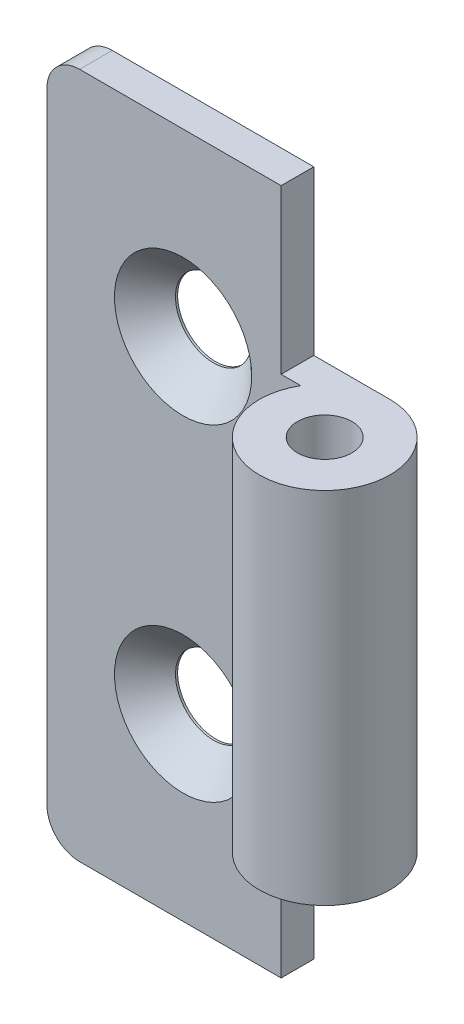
ISO-10303-21;
HEADER;
FILE_DESCRIPTION(('STEP AP214'),'2;1');
FILE_NAME('part.step','',(''),(''),'','','');
FILE_SCHEMA(('AUTOMOTIVE_DESIGN { 1 0 10303 214 1 1 1 1 }'));
ENDSEC;
DATA;
#1=APPLICATION_CONTEXT('core data for automotive mechanical design processes');
#2=APPLICATION_PROTOCOL_DEFINITION('international standard','automotive_design',2000,#1);
#3=PRODUCT_CONTEXT('',#1,'mechanical');
#4=PRODUCT('Part','Part','',(#3));
#5=PRODUCT_RELATED_PRODUCT_CATEGORY('part','',(#4));
#6=PRODUCT_DEFINITION_FORMATION('','',#4);
#7=PRODUCT_DEFINITION_CONTEXT('part definition',#1,'design');
#8=PRODUCT_DEFINITION('design','',#6,#7);
#9=PRODUCT_DEFINITION_SHAPE('','',#8);
#10=(LENGTH_UNIT() NAMED_UNIT(*) SI_UNIT(.MILLI.,.METRE.));
#11=(NAMED_UNIT(*) PLANE_ANGLE_UNIT() SI_UNIT($,.RADIAN.));
#12=(NAMED_UNIT(*) SI_UNIT($,.STERADIAN.) SOLID_ANGLE_UNIT());
#13=UNCERTAINTY_MEASURE_WITH_UNIT(LENGTH_MEASURE(1.E-05),#10,'distance_accuracy_value','');
#14=(GEOMETRIC_REPRESENTATION_CONTEXT(3) GLOBAL_UNCERTAINTY_ASSIGNED_CONTEXT((#13)) GLOBAL_UNIT_ASSIGNED_CONTEXT((#10,
#11,#12)) REPRESENTATION_CONTEXT('',''));
#15=CARTESIAN_POINT('',(0.,0.,0.));
#16=DIRECTION('',(0.,0.,1.));
#17=DIRECTION('',(1.,0.,0.));
#18=AXIS2_PLACEMENT_3D('',#15,#16,#17);
#19=CARTESIAN_POINT('',(0.,63.,0.));
#20=DIRECTION('',(0.,-1.,0.));
#21=DIRECTION('',(0.,0.,-1.));
#22=AXIS2_PLACEMENT_3D('',#19,#20,#21);
#23=CYLINDRICAL_SURFACE('',#22,6.);
#24=CARTESIAN_POINT('',(0.,15.,0.));
#25=DIRECTION('',(0.,1.,0.));
#26=DIRECTION('',(0.,0.,1.));
#27=AXIS2_PLACEMENT_3D('',#24,#25,#26);
#28=CIRCLE('',#27,6.);
#29=CARTESIAN_POINT('',(-5.19615242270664,15.,-3.));
#30=VERTEX_POINT('',#29);
#31=CARTESIAN_POINT('',(0.,15.,-6.));
#32=VERTEX_POINT('',#31);
#33=EDGE_CURVE('E145',#30,#32,#28,.T.);
#34=ORIENTED_EDGE('',*,*,#33,.T.);
#35=DIRECTION('',(0.,-1.,0.));
#36=VECTOR('',#35,1.);
#37=CARTESIAN_POINT('',(0.,63.,-6.));
#38=LINE('',#37,#36);
#39=CARTESIAN_POINT('',(0.,48.,-6.));
#40=VERTEX_POINT('',#39);
#41=EDGE_CURVE('E140',#40,#32,#38,.T.);
#42=ORIENTED_EDGE('',*,*,#41,.F.);
#43=CARTESIAN_POINT('',(0.,48.,0.));
#44=DIRECTION('',(0.,-1.,0.));
#45=DIRECTION('',(0.,0.,-1.));
#46=AXIS2_PLACEMENT_3D('',#43,#44,#45);
#47=CIRCLE('',#46,6.);
#48=CARTESIAN_POINT('',(-5.19615242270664,48.,-3.));
#49=VERTEX_POINT('',#48);
#50=EDGE_CURVE('E157',#40,#49,#47,.T.);
#51=ORIENTED_EDGE('',*,*,#50,.T.);
#52=DIRECTION('',(0.,-1.,0.));
#53=VECTOR('',#52,1.);
#54=CARTESIAN_POINT('',(-5.19615242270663,63.,-3.));
#55=LINE('',#54,#53);
#56=EDGE_CURVE('E165',#49,#30,#55,.T.);
#57=ORIENTED_EDGE('',*,*,#56,.T.);
#58=EDGE_LOOP('',(#34,#42,#51,#57));
#59=FACE_BOUND('',#58,.T.);
#60=ADVANCED_FACE('F35',(#59),#23,.T.);
#61=CARTESIAN_POINT('',(0.,63.,-6.));
#62=DIRECTION('',(0.,0.,1.));
#63=DIRECTION('',(1.,0.,0.));
#64=AXIS2_PLACEMENT_3D('',#61,#62,#63);
#65=PLANE('',#64);
#66=CARTESIAN_POINT('',(-16.,46.5,-6.));
#67=DIRECTION('',(0.,0.,1.));
#68=DIRECTION('',(1.,0.,0.));
#69=AXIS2_PLACEMENT_3D('',#66,#67,#68);
#70=CIRCLE('',#69,3.5);
#71=CARTESIAN_POINT('',(-12.5,46.5,-6.));
#72=VERTEX_POINT('',#71);
#73=EDGE_CURVE('E368',#72,#72,#70,.T.);
#74=ORIENTED_EDGE('',*,*,#73,.T.);
#75=EDGE_LOOP('',(#74));
#76=FACE_BOUND('',#75,.T.);
#77=CARTESIAN_POINT('',(-16.,16.5,-6.));
#78=DIRECTION('',(0.,0.,1.));
#79=DIRECTION('',(1.,0.,0.));
#80=AXIS2_PLACEMENT_3D('',#77,#78,#79);
#81=CIRCLE('',#80,3.5);
#82=CARTESIAN_POINT('',(-12.5,16.5,-6.));
#83=VERTEX_POINT('',#82);
#84=EDGE_CURVE('E135',#83,#83,#81,.T.);
#85=ORIENTED_EDGE('',*,*,#84,.T.);
#86=EDGE_LOOP('',(#85));
#87=FACE_BOUND('',#86,.T.);
#88=DIRECTION('',(-1.,0.,0.));
#89=VECTOR('',#88,1.);
#90=CARTESIAN_POINT('',(0.,0.,-6.));
#91=LINE('',#90,#89);
#92=CARTESIAN_POINT('',(-7.00000000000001,0.,-6.));
#93=VERTEX_POINT('',#92);
#94=CARTESIAN_POINT('',(-25.5,0.,-6.));
#95=VERTEX_POINT('',#94);
#96=EDGE_CURVE('E159',#93,#95,#91,.T.);
#97=ORIENTED_EDGE('',*,*,#96,.T.);
#98=CARTESIAN_POINT('',(-25.5,3.,-6.));
#99=DIRECTION('',(0.,0.,1.));
#100=DIRECTION('',(1.,0.,0.));
#101=AXIS2_PLACEMENT_3D('',#98,#99,#100);
#102=CIRCLE('',#101,3.);
#103=CARTESIAN_POINT('',(-28.5,3.,-6.));
#104=VERTEX_POINT('',#103);
#105=EDGE_CURVE('E44',#95,#104,#102,.F.);
#106=ORIENTED_EDGE('',*,*,#105,.T.);
#107=DIRECTION('',(0.,-1.,0.));
#108=VECTOR('',#107,1.);
#109=CARTESIAN_POINT('',(-28.5,63.,-6.));
#110=LINE('',#109,#108);
#111=CARTESIAN_POINT('',(-28.5,60.,-6.));
#112=VERTEX_POINT('',#111);
#113=EDGE_CURVE('E173',#112,#104,#110,.T.);
#114=ORIENTED_EDGE('',*,*,#113,.F.);
#115=CARTESIAN_POINT('',(-25.5,60.,-6.));
#116=DIRECTION('',(0.,0.,1.));
#117=DIRECTION('',(1.,0.,0.));
#118=AXIS2_PLACEMENT_3D('',#115,#116,#117);
#119=CIRCLE('',#118,3.);
#120=CARTESIAN_POINT('',(-25.5,63.,-6.));
#121=VERTEX_POINT('',#120);
#122=EDGE_CURVE('E51',#112,#121,#119,.F.);
#123=ORIENTED_EDGE('',*,*,#122,.T.);
#124=DIRECTION('',(-1.,0.,0.));
#125=VECTOR('',#124,1.);
#126=CARTESIAN_POINT('',(0.,63.,-6.));
#127=LINE('',#126,#125);
#128=CARTESIAN_POINT('',(-7.,63.,-6.));
#129=VERTEX_POINT('',#128);
#130=EDGE_CURVE('E160',#129,#121,#127,.T.);
#131=ORIENTED_EDGE('',*,*,#130,.F.);
#132=DIRECTION('',(0.,1.,0.));
#133=VECTOR('',#132,1.);
#134=CARTESIAN_POINT('',(-7.,48.,-6.));
#135=LINE('',#134,#133);
#136=CARTESIAN_POINT('',(-7.,48.,-6.));
#137=VERTEX_POINT('',#136);
#138=EDGE_CURVE('E150',#137,#129,#135,.T.);
#139=ORIENTED_EDGE('',*,*,#138,.F.);
#140=DIRECTION('',(-1.,0.,0.));
#141=VECTOR('',#140,1.);
#142=CARTESIAN_POINT('',(13.5139084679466,48.,-6.));
#143=LINE('',#142,#141);
#144=EDGE_CURVE('E147',#40,#137,#143,.T.);
#145=ORIENTED_EDGE('',*,*,#144,.F.);
#146=ORIENTED_EDGE('',*,*,#41,.T.);
#147=DIRECTION('',(1.,0.,0.));
#148=VECTOR('',#147,1.);
#149=CARTESIAN_POINT('',(13.5139084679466,15.,-6.));
#150=LINE('',#149,#148);
#151=CARTESIAN_POINT('',(-7.,15.,-6.));
#152=VERTEX_POINT('',#151);
#153=EDGE_CURVE('E121',#152,#32,#150,.T.);
#154=ORIENTED_EDGE('',*,*,#153,.F.);
#155=DIRECTION('',(0.,1.,0.));
#156=VECTOR('',#155,1.);
#157=CARTESIAN_POINT('',(-7.,15.,-6.));
#158=LINE('',#157,#156);
#159=EDGE_CURVE('E131',#93,#152,#158,.T.);
#160=ORIENTED_EDGE('',*,*,#159,.F.);
#161=EDGE_LOOP('',(#97,#106,#114,#123,#131,#139,#145,#146,#154,#160));
#162=FACE_BOUND('',#161,.T.);
#163=ADVANCED_FACE('F137',(#76,#87,#162),#65,.F.);
#164=CARTESIAN_POINT('',(-28.5,63.,-6.));
#165=DIRECTION('',(1.,0.,0.));
#166=DIRECTION('',(0.,0.,-1.));
#167=AXIS2_PLACEMENT_3D('',#164,#165,#166);
#168=PLANE('',#167);
#169=ORIENTED_EDGE('',*,*,#113,.T.);
#170=DIRECTION('',(0.,0.,1.));
#171=VECTOR('',#170,1.);
#172=CARTESIAN_POINT('',(-28.5,3.,-6.));
#173=LINE('',#172,#171);
#174=CARTESIAN_POINT('',(-28.5,3.,-3.));
#175=VERTEX_POINT('',#174);
#176=EDGE_CURVE('E187',#104,#175,#173,.T.);
#177=ORIENTED_EDGE('',*,*,#176,.T.);
#178=DIRECTION('',(0.,-1.,0.));
#179=VECTOR('',#178,1.);
#180=CARTESIAN_POINT('',(-28.5,63.,-3.));
#181=LINE('',#180,#179);
#182=CARTESIAN_POINT('',(-28.5,60.,-3.));
#183=VERTEX_POINT('',#182);
#184=EDGE_CURVE('E170',#183,#175,#181,.T.);
#185=ORIENTED_EDGE('',*,*,#184,.F.);
#186=DIRECTION('',(0.,0.,1.));
#187=VECTOR('',#186,1.);
#188=CARTESIAN_POINT('',(-28.5,60.,-6.));
#189=LINE('',#188,#187);
#190=EDGE_CURVE('E185',#183,#112,#189,.F.);
#191=ORIENTED_EDGE('',*,*,#190,.T.);
#192=EDGE_LOOP('',(#169,#177,#185,#191));
#193=FACE_BOUND('',#192,.T.);
#194=ADVANCED_FACE('F200',(#193),#168,.F.);
#195=CARTESIAN_POINT('',(-28.5,63.,-3.));
#196=DIRECTION('',(0.,0.,-1.));
#197=DIRECTION('',(-1.,0.,0.));
#198=AXIS2_PLACEMENT_3D('',#195,#196,#197);
#199=PLANE('',#198);
#200=CARTESIAN_POINT('',(-16.,46.5,-3.));
#201=DIRECTION('',(0.,0.,1.));
#202=DIRECTION('',(1.,0.,0.));
#203=AXIS2_PLACEMENT_3D('',#200,#201,#202);
#204=CIRCLE('',#203,6.3);
#205=CARTESIAN_POINT('',(-9.7,46.5,-3.));
#206=VERTEX_POINT('',#205);
#207=EDGE_CURVE('E362',#206,#206,#204,.T.);
#208=ORIENTED_EDGE('',*,*,#207,.F.);
#209=EDGE_LOOP('',(#208));
#210=FACE_BOUND('',#209,.T.);
#211=CARTESIAN_POINT('',(-16.,16.5,-3.));
#212=DIRECTION('',(0.,0.,1.));
#213=DIRECTION('',(1.,0.,0.));
#214=AXIS2_PLACEMENT_3D('',#211,#212,#213);
#215=CIRCLE('',#214,6.3);
#216=CARTESIAN_POINT('',(-9.7,16.5,-3.));
#217=VERTEX_POINT('',#216);
#218=EDGE_CURVE('E365',#217,#217,#215,.T.);
#219=ORIENTED_EDGE('',*,*,#218,.F.);
#220=EDGE_LOOP('',(#219));
#221=FACE_BOUND('',#220,.T.);
#222=ORIENTED_EDGE('',*,*,#184,.T.);
#223=CARTESIAN_POINT('',(-25.5,3.,-3.));
#224=DIRECTION('',(0.,0.,-1.));
#225=DIRECTION('',(-1.,0.,0.));
#226=AXIS2_PLACEMENT_3D('',#223,#224,#225);
#227=CIRCLE('',#226,3.);
#228=CARTESIAN_POINT('',(-25.5,0.,-3.));
#229=VERTEX_POINT('',#228);
#230=EDGE_CURVE('E192',#175,#229,#227,.F.);
#231=ORIENTED_EDGE('',*,*,#230,.T.);
#232=DIRECTION('',(1.,0.,0.));
#233=VECTOR('',#232,1.);
#234=CARTESIAN_POINT('',(-28.5,0.,-3.));
#235=LINE('',#234,#233);
#236=CARTESIAN_POINT('',(-7.00000000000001,0.,-3.));
#237=VERTEX_POINT('',#236);
#238=EDGE_CURVE('E163',#229,#237,#235,.T.);
#239=ORIENTED_EDGE('',*,*,#238,.T.);
#240=DIRECTION('',(0.,1.,0.));
#241=VECTOR('',#240,1.);
#242=CARTESIAN_POINT('',(-6.99999999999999,63.,-3.));
#243=LINE('',#242,#241);
#244=CARTESIAN_POINT('',(-7.,15.,-2.99999999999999));
#245=VERTEX_POINT('',#244);
#246=EDGE_CURVE('E128',#237,#245,#243,.T.);
#247=ORIENTED_EDGE('',*,*,#246,.T.);
#248=DIRECTION('',(1.,0.,0.));
#249=VECTOR('',#248,1.);
#250=CARTESIAN_POINT('',(-28.5,15.,-3.));
#251=LINE('',#250,#249);
#252=EDGE_CURVE('E124',#245,#30,#251,.T.);
#253=ORIENTED_EDGE('',*,*,#252,.T.);
#254=ORIENTED_EDGE('',*,*,#56,.F.);
#255=DIRECTION('',(-1.,0.,0.));
#256=VECTOR('',#255,1.);
#257=CARTESIAN_POINT('',(-28.5,48.,-3.));
#258=LINE('',#257,#256);
#259=CARTESIAN_POINT('',(-7.,48.,-2.99999999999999));
#260=VERTEX_POINT('',#259);
#261=EDGE_CURVE('E180',#49,#260,#258,.T.);
#262=ORIENTED_EDGE('',*,*,#261,.T.);
#263=DIRECTION('',(0.,1.,0.));
#264=VECTOR('',#263,1.);
#265=CARTESIAN_POINT('',(-7.,63.,-3.));
#266=LINE('',#265,#264);
#267=CARTESIAN_POINT('',(-7.,63.,-2.99999999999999));
#268=VERTEX_POINT('',#267);
#269=EDGE_CURVE('E154',#260,#268,#266,.T.);
#270=ORIENTED_EDGE('',*,*,#269,.T.);
#271=DIRECTION('',(1.,0.,0.));
#272=VECTOR('',#271,1.);
#273=CARTESIAN_POINT('',(-28.5,63.,-3.));
#274=LINE('',#273,#272);
#275=CARTESIAN_POINT('',(-25.5,63.,-3.));
#276=VERTEX_POINT('',#275);
#277=EDGE_CURVE('E162',#276,#268,#274,.T.);
#278=ORIENTED_EDGE('',*,*,#277,.F.);
#279=CARTESIAN_POINT('',(-25.5,60.,-3.));
#280=DIRECTION('',(0.,0.,-1.));
#281=DIRECTION('',(-1.,0.,0.));
#282=AXIS2_PLACEMENT_3D('',#279,#280,#281);
#283=CIRCLE('',#282,3.);
#284=EDGE_CURVE('E190',#276,#183,#283,.F.);
#285=ORIENTED_EDGE('',*,*,#284,.T.);
#286=EDGE_LOOP('',(#222,#231,#239,#247,#253,#254,#262,#270,#278,#285));
#287=FACE_BOUND('',#286,.T.);
#288=ADVANCED_FACE('F205',(#210,#221,#287),#199,.F.);
#289=CARTESIAN_POINT('',(0.,63.,0.));
#290=DIRECTION('',(0.,1.,0.));
#291=DIRECTION('',(0.,0.,1.));
#292=AXIS2_PLACEMENT_3D('',#289,#290,#291);
#293=PLANE('',#292);
#294=ORIENTED_EDGE('',*,*,#130,.T.);
#295=DIRECTION('',(0.,0.,1.));
#296=VECTOR('',#295,1.);
#297=CARTESIAN_POINT('',(-25.5,63.,-2.99999999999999));
#298=LINE('',#297,#296);
#299=EDGE_CURVE('E11',#121,#276,#298,.T.);
#300=ORIENTED_EDGE('',*,*,#299,.T.);
#301=ORIENTED_EDGE('',*,*,#277,.T.);
#302=DIRECTION('',(0.,0.,1.));
#303=VECTOR('',#302,1.);
#304=CARTESIAN_POINT('',(-7.,63.,0.));
#305=LINE('',#304,#303);
#306=EDGE_CURVE('E177',#129,#268,#305,.T.);
#307=ORIENTED_EDGE('',*,*,#306,.F.);
#308=EDGE_LOOP('',(#294,#300,#301,#307));
#309=FACE_BOUND('',#308,.T.);
#310=ADVANCED_FACE('F209',(#309),#293,.T.);
#311=CARTESIAN_POINT('',(0.,0.,0.));
#312=DIRECTION('',(0.,1.,0.));
#313=DIRECTION('',(0.,0.,1.));
#314=AXIS2_PLACEMENT_3D('',#311,#312,#313);
#315=PLANE('',#314);
#316=ORIENTED_EDGE('',*,*,#238,.F.);
#317=DIRECTION('',(0.,0.,1.));
#318=VECTOR('',#317,1.);
#319=CARTESIAN_POINT('',(-25.5,0.,0.));
#320=LINE('',#319,#318);
#321=EDGE_CURVE('E59',#229,#95,#320,.F.);
#322=ORIENTED_EDGE('',*,*,#321,.T.);
#323=ORIENTED_EDGE('',*,*,#96,.F.);
#324=DIRECTION('',(0.,0.,1.));
#325=VECTOR('',#324,1.);
#326=CARTESIAN_POINT('',(-7.,0.,0.));
#327=LINE('',#326,#325);
#328=EDGE_CURVE('E134',#93,#237,#327,.T.);
#329=ORIENTED_EDGE('',*,*,#328,.T.);
#330=EDGE_LOOP('',(#316,#322,#323,#329));
#331=FACE_BOUND('',#330,.T.);
#332=ADVANCED_FACE('F206',(#331),#315,.F.);
#333=CARTESIAN_POINT('',(13.5139084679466,48.,6.));
#334=DIRECTION('',(0.,-1.,0.));
#335=DIRECTION('',(0.,0.,-1.));
#336=AXIS2_PLACEMENT_3D('',#333,#334,#335);
#337=PLANE('',#336);
#338=CARTESIAN_POINT('',(0.,48.,0.));
#339=DIRECTION('',(0.,1.,0.));
#340=DIRECTION('',(0.,0.,1.));
#341=AXIS2_PLACEMENT_3D('',#338,#339,#340);
#342=CIRCLE('',#341,2.5);
#343=CARTESIAN_POINT('',(0.,48.,2.5));
#344=VERTEX_POINT('',#343);
#345=EDGE_CURVE('E384',#344,#344,#342,.T.);
#346=ORIENTED_EDGE('',*,*,#345,.F.);
#347=EDGE_LOOP('',(#346));
#348=FACE_BOUND('',#347,.T.);
#349=ORIENTED_EDGE('',*,*,#144,.T.);
#350=DIRECTION('',(0.,0.,-1.));
#351=VECTOR('',#350,1.);
#352=CARTESIAN_POINT('',(-7.,48.,6.));
#353=LINE('',#352,#351);
#354=EDGE_CURVE('E152',#260,#137,#353,.T.);
#355=ORIENTED_EDGE('',*,*,#354,.F.);
#356=ORIENTED_EDGE('',*,*,#261,.F.);
#357=ORIENTED_EDGE('',*,*,#50,.F.);
#358=EDGE_LOOP('',(#349,#355,#356,#357));
#359=FACE_BOUND('',#358,.T.);
#360=ADVANCED_FACE('F208',(#348,#359),#337,.F.);
#361=CARTESIAN_POINT('',(-7.,48.,6.));
#362=DIRECTION('',(-1.,0.,0.));
#363=DIRECTION('',(0.,0.,1.));
#364=AXIS2_PLACEMENT_3D('',#361,#362,#363);
#365=PLANE('',#364);
#366=ORIENTED_EDGE('',*,*,#354,.T.);
#367=ORIENTED_EDGE('',*,*,#138,.T.);
#368=ORIENTED_EDGE('',*,*,#306,.T.);
#369=ORIENTED_EDGE('',*,*,#269,.F.);
#370=EDGE_LOOP('',(#366,#367,#368,#369));
#371=FACE_BOUND('',#370,.T.);
#372=ADVANCED_FACE('F215',(#371),#365,.F.);
#373=CARTESIAN_POINT('',(13.5139084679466,15.,6.));
#374=DIRECTION('',(0.,1.,0.));
#375=DIRECTION('',(0.,0.,1.));
#376=AXIS2_PLACEMENT_3D('',#373,#374,#375);
#377=PLANE('',#376);
#378=CARTESIAN_POINT('',(0.,15.,0.));
#379=DIRECTION('',(0.,1.,0.));
#380=DIRECTION('',(0.,0.,1.));
#381=AXIS2_PLACEMENT_3D('',#378,#379,#380);
#382=CIRCLE('',#381,2.5);
#383=CARTESIAN_POINT('',(0.,15.,2.5));
#384=VERTEX_POINT('',#383);
#385=EDGE_CURVE('E39',#384,#384,#382,.T.);
#386=ORIENTED_EDGE('',*,*,#385,.T.);
#387=EDGE_LOOP('',(#386));
#388=FACE_BOUND('',#387,.T.);
#389=ORIENTED_EDGE('',*,*,#33,.F.);
#390=ORIENTED_EDGE('',*,*,#252,.F.);
#391=DIRECTION('',(0.,0.,-1.));
#392=VECTOR('',#391,1.);
#393=CARTESIAN_POINT('',(-7.,15.,6.));
#394=LINE('',#393,#392);
#395=EDGE_CURVE('E117',#245,#152,#394,.T.);
#396=ORIENTED_EDGE('',*,*,#395,.T.);
#397=ORIENTED_EDGE('',*,*,#153,.T.);
#398=EDGE_LOOP('',(#389,#390,#396,#397));
#399=FACE_BOUND('',#398,.T.);
#400=ADVANCED_FACE('F119',(#388,#399),#377,.F.);
#401=CARTESIAN_POINT('',(-7.,15.,6.));
#402=DIRECTION('',(-1.,0.,0.));
#403=DIRECTION('',(0.,-1.,0.));
#404=AXIS2_PLACEMENT_3D('',#401,#402,#403);
#405=PLANE('',#404);
#406=ORIENTED_EDGE('',*,*,#328,.F.);
#407=ORIENTED_EDGE('',*,*,#159,.T.);
#408=ORIENTED_EDGE('',*,*,#395,.F.);
#409=ORIENTED_EDGE('',*,*,#246,.F.);
#410=EDGE_LOOP('',(#406,#407,#408,#409));
#411=FACE_BOUND('',#410,.T.);
#412=ADVANCED_FACE('F132',(#411),#405,.F.);
#413=CARTESIAN_POINT('',(-25.5,3.,-5.99999999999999));
#414=DIRECTION('',(0.,0.,1.));
#415=DIRECTION('',(1.,0.,0.));
#416=AXIS2_PLACEMENT_3D('',#413,#414,#415);
#417=CYLINDRICAL_SURFACE('',#416,3.);
#418=ORIENTED_EDGE('',*,*,#105,.F.);
#419=ORIENTED_EDGE('',*,*,#321,.F.);
#420=ORIENTED_EDGE('',*,*,#230,.F.);
#421=ORIENTED_EDGE('',*,*,#176,.F.);
#422=EDGE_LOOP('',(#418,#419,#420,#421));
#423=FACE_BOUND('',#422,.T.);
#424=ADVANCED_FACE('F203',(#423),#417,.T.);
#425=CARTESIAN_POINT('',(-25.5,60.,0.));
#426=DIRECTION('',(0.,0.,-1.));
#427=DIRECTION('',(-1.,0.,0.));
#428=AXIS2_PLACEMENT_3D('',#425,#426,#427);
#429=CYLINDRICAL_SURFACE('',#428,3.);
#430=ORIENTED_EDGE('',*,*,#122,.F.);
#431=ORIENTED_EDGE('',*,*,#190,.F.);
#432=ORIENTED_EDGE('',*,*,#284,.F.);
#433=ORIENTED_EDGE('',*,*,#299,.F.);
#434=EDGE_LOOP('',(#430,#431,#432,#433));
#435=FACE_BOUND('',#434,.T.);
#436=ADVANCED_FACE('F37',(#435),#429,.T.);
#437=CARTESIAN_POINT('',(-16.,16.5,-3.));
#438=DIRECTION('',(0.,0.,1.));
#439=DIRECTION('',(1.,0.,0.));
#440=AXIS2_PLACEMENT_3D('',#437,#438,#439);
#441=CYLINDRICAL_SURFACE('',#440,3.49999999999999);
#442=ORIENTED_EDGE('',*,*,#84,.F.);
#443=EDGE_LOOP('',(#442));
#444=FACE_BOUND('',#443,.T.);
#445=CARTESIAN_POINT('',(-16.,16.5,-5.80000000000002));
#446=DIRECTION('',(0.,0.,1.));
#447=DIRECTION('',(1.,0.,0.));
#448=AXIS2_PLACEMENT_3D('',#445,#446,#447);
#449=CIRCLE('',#448,3.49999999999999);
#450=CARTESIAN_POINT('',(-12.5,16.5,-5.80000000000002));
#451=VERTEX_POINT('',#450);
#452=EDGE_CURVE('E367',#451,#451,#449,.T.);
#453=ORIENTED_EDGE('',*,*,#452,.T.);
#454=EDGE_LOOP('',(#453));
#455=FACE_BOUND('',#454,.T.);
#456=ADVANCED_FACE('F235',(#444,#455),#441,.F.);
#457=CARTESIAN_POINT('',(-16.,16.5,-3.));
#458=DIRECTION('',(0.,0.,1.));
#459=DIRECTION('',(1.,0.,0.));
#460=AXIS2_PLACEMENT_3D('',#457,#458,#459);
#461=CONICAL_SURFACE('',#460,6.3,0.785398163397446);
#462=ORIENTED_EDGE('',*,*,#452,.F.);
#463=EDGE_LOOP('',(#462));
#464=FACE_BOUND('',#463,.T.);
#465=ORIENTED_EDGE('',*,*,#218,.T.);
#466=EDGE_LOOP('',(#465));
#467=FACE_BOUND('',#466,.T.);
#468=ADVANCED_FACE('F293',(#464,#467),#461,.F.);
#469=CARTESIAN_POINT('',(-16.,46.5,-3.));
#470=DIRECTION('',(0.,0.,1.));
#471=DIRECTION('',(1.,0.,0.));
#472=AXIS2_PLACEMENT_3D('',#469,#470,#471);
#473=CYLINDRICAL_SURFACE('',#472,3.49999999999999);
#474=ORIENTED_EDGE('',*,*,#73,.F.);
#475=EDGE_LOOP('',(#474));
#476=FACE_BOUND('',#475,.T.);
#477=CARTESIAN_POINT('',(-16.,46.5,-5.80000000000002));
#478=DIRECTION('',(0.,0.,1.));
#479=DIRECTION('',(1.,0.,0.));
#480=AXIS2_PLACEMENT_3D('',#477,#478,#479);
#481=CIRCLE('',#480,3.49999999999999);
#482=CARTESIAN_POINT('',(-12.5,46.5,-5.80000000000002));
#483=VERTEX_POINT('',#482);
#484=EDGE_CURVE('E373',#483,#483,#481,.T.);
#485=ORIENTED_EDGE('',*,*,#484,.T.);
#486=EDGE_LOOP('',(#485));
#487=FACE_BOUND('',#486,.T.);
#488=ADVANCED_FACE('F286',(#476,#487),#473,.F.);
#489=CARTESIAN_POINT('',(-16.,46.5,-3.));
#490=DIRECTION('',(0.,0.,1.));
#491=DIRECTION('',(1.,0.,0.));
#492=AXIS2_PLACEMENT_3D('',#489,#490,#491);
#493=CONICAL_SURFACE('',#492,6.3,0.785398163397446);
#494=ORIENTED_EDGE('',*,*,#484,.F.);
#495=EDGE_LOOP('',(#494));
#496=FACE_BOUND('',#495,.T.);
#497=ORIENTED_EDGE('',*,*,#207,.T.);
#498=EDGE_LOOP('',(#497));
#499=FACE_BOUND('',#498,.T.);
#500=ADVANCED_FACE('F276',(#496,#499),#493,.F.);
#501=CARTESIAN_POINT('',(0.,0.,0.));
#502=DIRECTION('',(0.,1.,0.));
#503=DIRECTION('',(0.,0.,1.));
#504=AXIS2_PLACEMENT_3D('',#501,#502,#503);
#505=CYLINDRICAL_SURFACE('',#504,2.5);
#506=ORIENTED_EDGE('',*,*,#345,.T.);
#507=EDGE_LOOP('',(#506));
#508=FACE_BOUND('',#507,.T.);
#509=ORIENTED_EDGE('',*,*,#385,.F.);
#510=EDGE_LOOP('',(#509));
#511=FACE_BOUND('',#510,.T.);
#512=ADVANCED_FACE('F272',(#508,#511),#505,.F.);
#513=CLOSED_SHELL('',(#60,#163,#194,#288,#310,#332,#360,#372,#400,#412,#424,#436,#456,#468,#488,
#500,#512));
#514=MANIFOLD_SOLID_BREP('B2',#513);
#515=ADVANCED_BREP_SHAPE_REPRESENTATION('',(#18,#514),#14);
#516=SHAPE_DEFINITION_REPRESENTATION(#9,#515);
ENDSEC;
END-ISO-10303-21;
